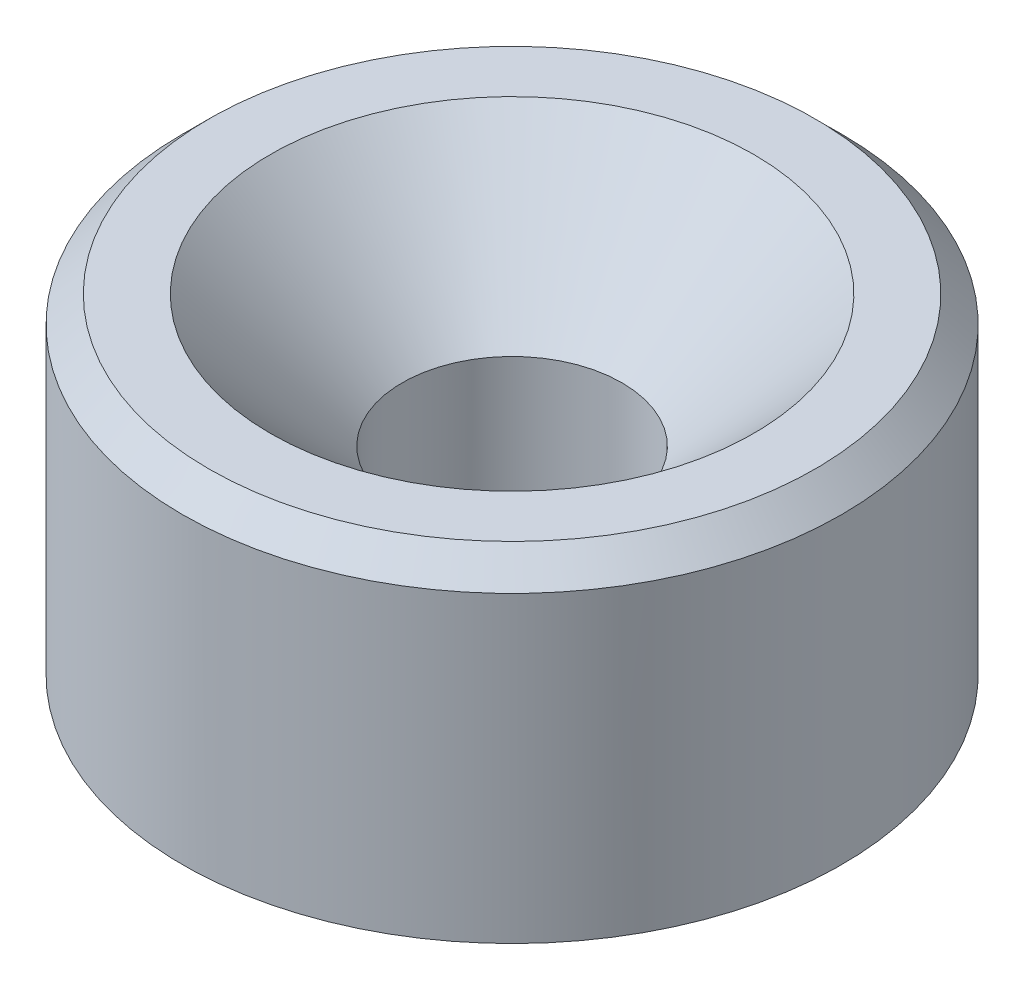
ISO-10303-21;
HEADER;
FILE_DESCRIPTION(('STEP AP214'),'2;1');
FILE_NAME('part.step','',(''),(''),'','','');
FILE_SCHEMA(('AUTOMOTIVE_DESIGN { 1 0 10303 214 1 1 1 1 }'));
ENDSEC;
DATA;
#1=APPLICATION_CONTEXT('core data for automotive mechanical design processes');
#2=APPLICATION_PROTOCOL_DEFINITION('international standard','automotive_design',2000,#1);
#3=PRODUCT_CONTEXT('',#1,'mechanical');
#4=PRODUCT('Part','Part','',(#3));
#5=PRODUCT_RELATED_PRODUCT_CATEGORY('part','',(#4));
#6=PRODUCT_DEFINITION_FORMATION('','',#4);
#7=PRODUCT_DEFINITION_CONTEXT('part definition',#1,'design');
#8=PRODUCT_DEFINITION('design','',#6,#7);
#9=PRODUCT_DEFINITION_SHAPE('','',#8);
#10=(LENGTH_UNIT() NAMED_UNIT(*) SI_UNIT(.MILLI.,.METRE.));
#11=(NAMED_UNIT(*) PLANE_ANGLE_UNIT() SI_UNIT($,.RADIAN.));
#12=(NAMED_UNIT(*) SI_UNIT($,.STERADIAN.) SOLID_ANGLE_UNIT());
#13=UNCERTAINTY_MEASURE_WITH_UNIT(LENGTH_MEASURE(1.E-05),#10,'distance_accuracy_value','');
#14=(GEOMETRIC_REPRESENTATION_CONTEXT(3) GLOBAL_UNCERTAINTY_ASSIGNED_CONTEXT((#13)) GLOBAL_UNIT_ASSIGNED_CONTEXT((#10,
#11,#12)) REPRESENTATION_CONTEXT('',''));
#15=CARTESIAN_POINT('',(0.,0.,0.));
#16=DIRECTION('',(0.,0.,1.));
#17=DIRECTION('',(1.,0.,0.));
#18=AXIS2_PLACEMENT_3D('',#15,#16,#17);
#19=CARTESIAN_POINT('',(0.,0.,0.));
#20=DIRECTION('',(0.,-1.,0.));
#21=DIRECTION('',(0.,0.,-1.));
#22=AXIS2_PLACEMENT_3D('',#19,#20,#21);
#23=PLANE('',#22);
#24=CARTESIAN_POINT('',(0.,0.,0.));
#25=DIRECTION('',(0.,-1.,0.));
#26=DIRECTION('',(0.,0.,-1.));
#27=AXIS2_PLACEMENT_3D('',#24,#25,#26);
#28=CIRCLE('',#27,3.175);
#29=CARTESIAN_POINT('',(0.,0.,-3.175));
#30=VERTEX_POINT('',#29);
#31=EDGE_CURVE('E51',#30,#30,#28,.T.);
#32=ORIENTED_EDGE('',*,*,#31,.F.);
#33=EDGE_LOOP('',(#32));
#34=FACE_BOUND('',#33,.T.);
#35=CARTESIAN_POINT('',(0.,0.,0.));
#36=DIRECTION('',(0.,-1.,0.));
#37=DIRECTION('',(0.,0.,-1.));
#38=AXIS2_PLACEMENT_3D('',#35,#36,#37);
#39=CIRCLE('',#38,9.525);
#40=CARTESIAN_POINT('',(0.,0.,-9.525));
#41=VERTEX_POINT('',#40);
#42=EDGE_CURVE('E42',#41,#41,#39,.T.);
#43=ORIENTED_EDGE('',*,*,#42,.T.);
#44=EDGE_LOOP('',(#43));
#45=FACE_BOUND('',#44,.T.);
#46=ADVANCED_FACE('F31',(#34,#45),#23,.T.);
#47=CARTESIAN_POINT('',(0.,0.,0.));
#48=DIRECTION('',(0.,-1.,0.));
#49=DIRECTION('',(0.,0.,-1.));
#50=AXIS2_PLACEMENT_3D('',#47,#48,#49);
#51=CYLINDRICAL_SURFACE('',#50,9.525);
#52=CARTESIAN_POINT('',(0.,8.76299999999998,0.));
#53=DIRECTION('',(0.,1.,0.));
#54=DIRECTION('',(0.,0.,1.));
#55=AXIS2_PLACEMENT_3D('',#52,#53,#54);
#56=CIRCLE('',#55,9.525);
#57=CARTESIAN_POINT('',(0.,8.76299999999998,9.525));
#58=VERTEX_POINT('',#57);
#59=EDGE_CURVE('E38',#58,#58,#56,.F.);
#60=ORIENTED_EDGE('',*,*,#59,.T.);
#61=EDGE_LOOP('',(#60));
#62=FACE_BOUND('',#61,.T.);
#63=ORIENTED_EDGE('',*,*,#42,.F.);
#64=EDGE_LOOP('',(#63));
#65=FACE_BOUND('',#64,.T.);
#66=ADVANCED_FACE('F62',(#62,#65),#51,.T.);
#67=CARTESIAN_POINT('',(6.985,9.52499999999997,0.));
#68=DIRECTION('',(0.,1.,0.));
#69=DIRECTION('',(0.,0.,1.));
#70=AXIS2_PLACEMENT_3D('',#67,#68,#69);
#71=PLANE('',#70);
#72=CARTESIAN_POINT('',(0.,9.52499999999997,0.));
#73=DIRECTION('',(0.,1.,0.));
#74=DIRECTION('',(0.,0.,1.));
#75=AXIS2_PLACEMENT_3D('',#72,#73,#74);
#76=CIRCLE('',#75,8.763);
#77=CARTESIAN_POINT('',(0.,9.52499999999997,8.763));
#78=VERTEX_POINT('',#77);
#79=EDGE_CURVE('E10',#78,#78,#76,.T.);
#80=ORIENTED_EDGE('',*,*,#79,.T.);
#81=EDGE_LOOP('',(#80));
#82=FACE_BOUND('',#81,.T.);
#83=CARTESIAN_POINT('',(0.,9.52499999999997,0.));
#84=DIRECTION('',(0.,-1.,0.));
#85=DIRECTION('',(0.,0.,-1.));
#86=AXIS2_PLACEMENT_3D('',#83,#84,#85);
#87=CIRCLE('',#86,6.985);
#88=CARTESIAN_POINT('',(0.,9.52499999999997,-6.985));
#89=VERTEX_POINT('',#88);
#90=EDGE_CURVE('E46',#89,#89,#87,.T.);
#91=ORIENTED_EDGE('',*,*,#90,.T.);
#92=EDGE_LOOP('',(#91));
#93=FACE_BOUND('',#92,.T.);
#94=ADVANCED_FACE('F66',(#82,#93),#71,.T.);
#95=CARTESIAN_POINT('',(0.,9.52499999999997,0.));
#96=DIRECTION('',(0.,1.,0.));
#97=DIRECTION('',(0.,0.,1.));
#98=AXIS2_PLACEMENT_3D('',#95,#96,#97);
#99=CONICAL_SURFACE('',#98,6.985,0.78539816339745);
#100=CARTESIAN_POINT('',(0.,5.71499999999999,0.));
#101=DIRECTION('',(0.,1.,0.));
#102=DIRECTION('',(0.,0.,1.));
#103=AXIS2_PLACEMENT_3D('',#100,#101,#102);
#104=CIRCLE('',#103,3.175);
#105=CARTESIAN_POINT('',(0.,5.71499999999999,3.175));
#106=VERTEX_POINT('',#105);
#107=EDGE_CURVE('E49',#106,#106,#104,.T.);
#108=ORIENTED_EDGE('',*,*,#107,.F.);
#109=EDGE_LOOP('',(#108));
#110=FACE_BOUND('',#109,.T.);
#111=ORIENTED_EDGE('',*,*,#90,.F.);
#112=EDGE_LOOP('',(#111));
#113=FACE_BOUND('',#112,.T.);
#114=ADVANCED_FACE('F71',(#110,#113),#99,.F.);
#115=CARTESIAN_POINT('',(0.,9.52499999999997,0.));
#116=DIRECTION('',(0.,-1.,0.));
#117=DIRECTION('',(0.,0.,-1.));
#118=AXIS2_PLACEMENT_3D('',#115,#116,#117);
#119=CYLINDRICAL_SURFACE('',#118,3.175);
#120=ORIENTED_EDGE('',*,*,#107,.T.);
#121=EDGE_LOOP('',(#120));
#122=FACE_BOUND('',#121,.T.);
#123=ORIENTED_EDGE('',*,*,#31,.T.);
#124=EDGE_LOOP('',(#123));
#125=FACE_BOUND('',#124,.T.);
#126=ADVANCED_FACE('F58',(#122,#125),#119,.F.);
#127=CARTESIAN_POINT('',(0.,8.76299999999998,0.));
#128=DIRECTION('',(0.,-1.,0.));
#129=DIRECTION('',(0.,0.,-1.));
#130=AXIS2_PLACEMENT_3D('',#127,#128,#129);
#131=CONICAL_SURFACE('',#130,9.525,0.785398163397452);
#132=ORIENTED_EDGE('',*,*,#79,.F.);
#133=EDGE_LOOP('',(#132));
#134=FACE_BOUND('',#133,.T.);
#135=ORIENTED_EDGE('',*,*,#59,.F.);
#136=EDGE_LOOP('',(#135));
#137=FACE_BOUND('',#136,.T.);
#138=ADVANCED_FACE('F33',(#134,#137),#131,.T.);
#139=CLOSED_SHELL('',(#46,#66,#94,#114,#126,#138));
#140=MANIFOLD_SOLID_BREP('B2',#139);
#141=ADVANCED_BREP_SHAPE_REPRESENTATION('',(#18,#140),#14);
#142=SHAPE_DEFINITION_REPRESENTATION(#9,#141);
ENDSEC;
END-ISO-10303-21;
